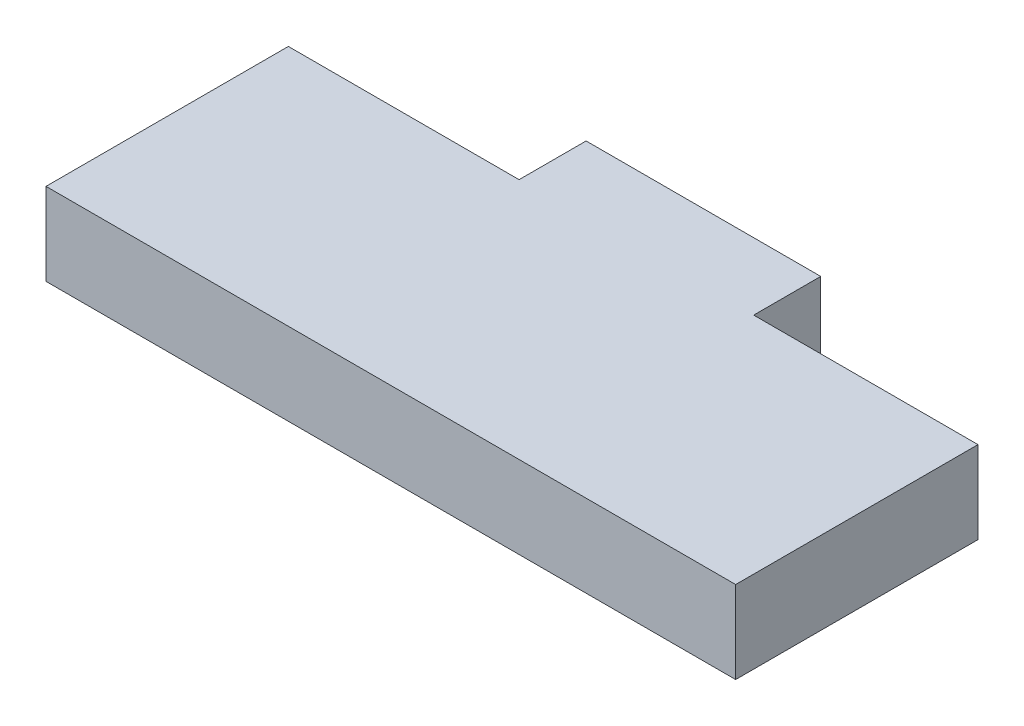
from build123d import *

# Parameters (mm, degrees)
BOSS_EXTRUDE1_DEPTH = 10


with BuildPart() as part:
    # Sketch1 → Boss-Extrude1 (new body)
    with BuildSketch(Plane(origin=(0, 0, 0), x_dir=(1, 0, 0), z_dir=(0, 1, 0))):
        Polygon((-10.021978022, 8.142857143), (18.478021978, 8.142857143), (18.478021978, 0), (45.725274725, 0), (45.725274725, -29.43956044), (-38.052197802, -29.43956044), (-38.052197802, 0), (-10.021978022, 0), align=None)
    extrude(amount=BOSS_EXTRUDE1_DEPTH)


solid = part.part
